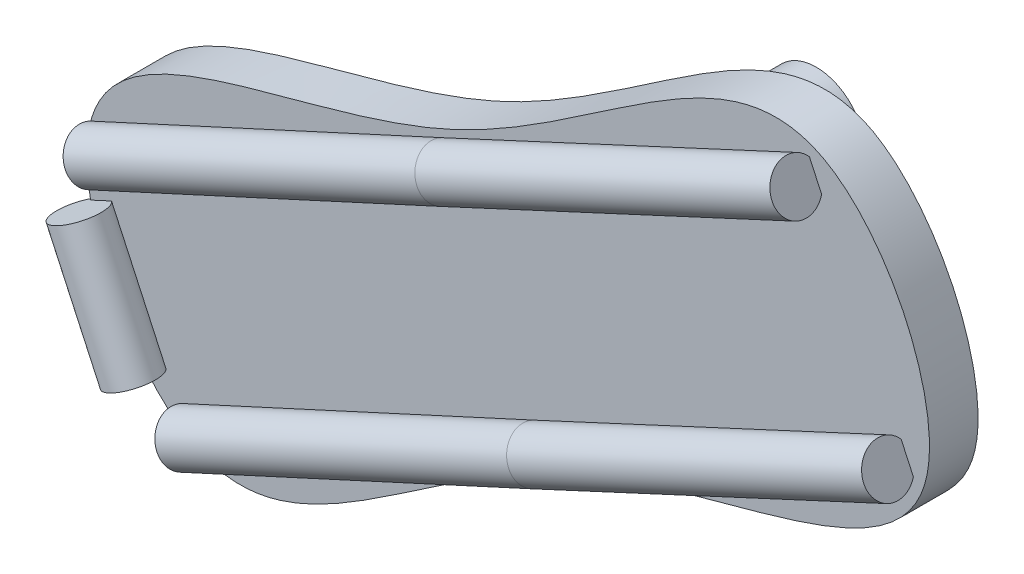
ISO-10303-21;
HEADER;
FILE_DESCRIPTION(('STEP AP214'),'2;1');
FILE_NAME('part.step','',(''),(''),'','','');
FILE_SCHEMA(('AUTOMOTIVE_DESIGN { 1 0 10303 214 1 1 1 1 }'));
ENDSEC;
DATA;
#1=APPLICATION_CONTEXT('core data for automotive mechanical design processes');
#2=APPLICATION_PROTOCOL_DEFINITION('international standard','automotive_design',2000,#1);
#3=PRODUCT_CONTEXT('',#1,'mechanical');
#4=PRODUCT('Part','Part','',(#3));
#5=PRODUCT_RELATED_PRODUCT_CATEGORY('part','',(#4));
#6=PRODUCT_DEFINITION_FORMATION('','',#4);
#7=PRODUCT_DEFINITION_CONTEXT('part definition',#1,'design');
#8=PRODUCT_DEFINITION('design','',#6,#7);
#9=PRODUCT_DEFINITION_SHAPE('','',#8);
#10=(LENGTH_UNIT() NAMED_UNIT(*) SI_UNIT(.MILLI.,.METRE.));
#11=(NAMED_UNIT(*) PLANE_ANGLE_UNIT() SI_UNIT($,.RADIAN.));
#12=(NAMED_UNIT(*) SI_UNIT($,.STERADIAN.) SOLID_ANGLE_UNIT());
#13=UNCERTAINTY_MEASURE_WITH_UNIT(LENGTH_MEASURE(1.E-05),#10,'distance_accuracy_value','');
#14=(GEOMETRIC_REPRESENTATION_CONTEXT(3) GLOBAL_UNCERTAINTY_ASSIGNED_CONTEXT((#13)) GLOBAL_UNIT_ASSIGNED_CONTEXT((#10,
#11,#12)) REPRESENTATION_CONTEXT('',''));
#15=CARTESIAN_POINT('',(0.,0.,0.));
#16=DIRECTION('',(0.,0.,1.));
#17=DIRECTION('',(1.,0.,0.));
#18=AXIS2_PLACEMENT_3D('',#15,#16,#17);
#19=CARTESIAN_POINT('',(429.779372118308,345.627534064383,-19.));
#20=CARTESIAN_POINT('',(429.353777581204,343.448573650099,-19.));
#21=CARTESIAN_POINT('',(430.470394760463,337.686186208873,-19.));
#22=CARTESIAN_POINT('',(440.028296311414,325.706179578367,-19.));
#23=CARTESIAN_POINT('',(456.920427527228,346.479501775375,-19.));
#24=CARTESIAN_POINT('',(483.687704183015,345.856675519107,-19.));
#25=CARTESIAN_POINT('',(480.772191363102,360.902400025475,-19.));
#26=CARTESIAN_POINT('',(471.214289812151,372.88240665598,-19.));
#27=CARTESIAN_POINT('',(454.322158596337,352.109084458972,-19.));
#28=CARTESIAN_POINT('',(431.150657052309,352.648243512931,-19.));
#29=CARTESIAN_POINT('',(429.779372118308,345.627534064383,-19.));
#30=B_SPLINE_CURVE_WITH_KNOTS('',3,(#19,#20,#21,#22,#23,#24,#25,#26,#27,#28,#29),.UNSPECIFIED.,
.T.,.F.,(4,1,1,1,1,1,1,1,4),(0.,0.0592130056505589,0.118426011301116,0.309213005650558,0.5,
0.559213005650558,0.618426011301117,0.809213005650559,1.),.UNSPECIFIED.);
#31=DIRECTION('',(0.,0.,1.));
#32=VECTOR('',#31,1.);
#33=SURFACE_OF_LINEAR_EXTRUSION('',#30,#32);
#34=CARTESIAN_POINT('',(429.779372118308,345.627534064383,-19.));
#35=VERTEX_POINT('',#34);
#36=EDGE_CURVE('E285',#35,#35,#30,.T.);
#37=ORIENTED_EDGE('',*,*,#36,.T.);
#38=EDGE_LOOP('',(#37));
#39=FACE_BOUND('',#38,.T.);
#40=CARTESIAN_POINT('',(431.978308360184,336.329195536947,-16.));
#41=CARTESIAN_POINT('',(432.024911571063,336.251450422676,-16.0072990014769));
#42=CARTESIAN_POINT('',(432.072119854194,336.174102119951,-16.0149528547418));
#43=CARTESIAN_POINT('',(432.167713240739,336.02028840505,-16.0308207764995));
#44=CARTESIAN_POINT('',(432.216097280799,335.943822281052,-16.0390343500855));
#45=CARTESIAN_POINT('',(432.314061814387,335.791770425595,-16.0558805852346));
#46=CARTESIAN_POINT('',(432.363641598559,335.716184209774,-16.0645130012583));
#47=CARTESIAN_POINT('',(432.464023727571,335.565892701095,-16.0820509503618));
#48=CARTESIAN_POINT('',(432.514825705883,335.491187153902,-16.0909564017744));
#49=CARTESIAN_POINT('',(432.617685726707,335.342657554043,-16.1088919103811));
#50=CARTESIAN_POINT('',(432.669743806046,335.268833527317,-16.1179219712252));
#51=CARTESIAN_POINT('',(432.775150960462,335.122078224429,-16.1359528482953));
#52=CARTESIAN_POINT('',(432.828500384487,335.049147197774,-16.1449536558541));
#53=CARTESIAN_POINT('',(432.93653302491,334.904189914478,-16.1627674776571));
#54=CARTESIAN_POINT('',(432.991216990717,334.832164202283,-16.1715803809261));
#55=CARTESIAN_POINT('',(433.10196944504,334.689035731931,-16.1888488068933));
#56=CARTESIAN_POINT('',(433.158039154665,334.617933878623,-16.1973039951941));
#57=CARTESIAN_POINT('',(433.214791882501,334.547347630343,-16.2054899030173));
#58=B_SPLINE_CURVE_WITH_KNOTS('',3,(#40,#41,#42,#43,#44,#45,#46,#47,#48,#49,#50,#51,#52,#53,#54,
#55,#56,#57),.UNSPECIFIED.,.F.,.F.,(4,2,2,2,2,2,2,2,4),(0.,0.272804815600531,0.545371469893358,
0.81778022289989,1.09010827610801,1.36244432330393,1.6348548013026,1.90742194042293,
2.18023849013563),.UNSPECIFIED.);
#59=CARTESIAN_POINT('',(431.978308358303,336.329195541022,-16.));
#60=VERTEX_POINT('',#59);
#61=CARTESIAN_POINT('',(433.214791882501,334.547347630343,-16.2054899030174));
#62=VERTEX_POINT('',#61);
#63=EDGE_CURVE('E164',#60,#62,#58,.T.);
#64=ORIENTED_EDGE('',*,*,#63,.F.);
#65=CARTESIAN_POINT('',(429.779372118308,345.627534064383,-16.));
#66=CARTESIAN_POINT('',(429.353777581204,343.448573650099,-16.));
#67=CARTESIAN_POINT('',(430.470394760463,337.686186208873,-16.));
#68=CARTESIAN_POINT('',(440.028296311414,325.706179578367,-16.));
#69=CARTESIAN_POINT('',(456.920427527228,346.479501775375,-16.));
#70=CARTESIAN_POINT('',(483.687704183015,345.856675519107,-16.));
#71=CARTESIAN_POINT('',(480.772191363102,360.902400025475,-16.));
#72=CARTESIAN_POINT('',(471.214289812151,372.88240665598,-16.));
#73=CARTESIAN_POINT('',(454.322158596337,352.109084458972,-16.));
#74=CARTESIAN_POINT('',(431.150657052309,352.648243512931,-16.));
#75=CARTESIAN_POINT('',(429.779372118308,345.627534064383,-16.));
#76=B_SPLINE_CURVE_WITH_KNOTS('',3,(#65,#66,#67,#68,#69,#70,#71,#72,#73,#74,#75),.UNSPECIFIED.,
.T.,.F.,(4,1,1,1,1,1,1,1,4),(0.,0.0592130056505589,0.118426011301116,0.309213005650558,0.5,
0.559213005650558,0.618426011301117,0.809213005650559,1.),.UNSPECIFIED.);
#77=CARTESIAN_POINT('',(430.416062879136,339.714060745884,-16.));
#78=VERTEX_POINT('',#77);
#79=EDGE_CURVE('E288',#78,#60,#76,.T.);
#80=ORIENTED_EDGE('',*,*,#79,.F.);
#81=CARTESIAN_POINT('',(429.862326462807,341.811022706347,-16.2054899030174));
#82=CARTESIAN_POINT('',(429.879220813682,341.722040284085,-16.1973039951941));
#83=CARTESIAN_POINT('',(429.896950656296,341.633243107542,-16.1888488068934));
#84=CARTESIAN_POINT('',(429.934013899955,341.456104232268,-16.171580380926));
#85=CARTESIAN_POINT('',(429.953345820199,341.367762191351,-16.1627674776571));
#86=CARTESIAN_POINT('',(429.993565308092,341.191506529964,-16.1449536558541));
#87=CARTESIAN_POINT('',(430.014451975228,341.103592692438,-16.1359528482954));
#88=CARTESIAN_POINT('',(430.057743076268,340.928168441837,-16.1179219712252));
#89=CARTESIAN_POINT('',(430.080147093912,340.840657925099,-16.108891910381));
#90=CARTESIAN_POINT('',(430.126440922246,340.666020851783,-16.0909564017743));
#91=CARTESIAN_POINT('',(430.150330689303,340.57889428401,-16.0820509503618));
#92=CARTESIAN_POINT('',(430.199572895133,340.404999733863,-16.0645130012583));
#93=CARTESIAN_POINT('',(430.224925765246,340.3182318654,-16.0558805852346));
#94=CARTESIAN_POINT('',(430.277076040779,340.145034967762,-16.0390343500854));
#95=CARTESIAN_POINT('',(430.303874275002,340.058606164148,-16.0308207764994));
#96=CARTESIAN_POINT('',(430.358903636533,339.886070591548,-16.0149528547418));
#97=CARTESIAN_POINT('',(430.387135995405,339.799964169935,-16.0072990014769));
#98=CARTESIAN_POINT('',(430.416062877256,339.714060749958,-16.));
#99=B_SPLINE_CURVE_WITH_KNOTS('',3,(#81,#82,#83,#84,#85,#86,#87,#88,#89,#90,#91,#92,#93,#94,#95,
#96,#97,#98),.UNSPECIFIED.,.F.,.F.,(4,2,2,2,2,2,2,2,4),(0.,0.27281654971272,0.545383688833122,
0.817794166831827,1.09013021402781,1.36245826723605,1.63486702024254,1.90743367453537,
2.18023849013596),.UNSPECIFIED.);
#100=CARTESIAN_POINT('',(429.862326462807,341.811022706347,-16.2054899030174));
#101=VERTEX_POINT('',#100);
#102=EDGE_CURVE('E168',#101,#78,#99,.T.);
#103=ORIENTED_EDGE('',*,*,#102,.F.);
#104=DIRECTION('',(0.,0.,1.));
#105=VECTOR('',#104,1.);
#106=CARTESIAN_POINT('',(429.862326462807,341.811022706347,-19.));
#107=LINE('',#106,#105);
#108=CARTESIAN_POINT('',(429.862326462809,341.811022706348,-16.));
#109=VERTEX_POINT('',#108);
#110=EDGE_CURVE('E289',#101,#109,#107,.T.);
#111=ORIENTED_EDGE('',*,*,#110,.T.);
#112=CARTESIAN_POINT('',(433.214791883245,334.547347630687,-16.));
#113=VERTEX_POINT('',#112);
#114=EDGE_CURVE('E303',#113,#109,#76,.T.);
#115=ORIENTED_EDGE('',*,*,#114,.F.);
#116=DIRECTION('',(0.,0.,1.));
#117=VECTOR('',#116,1.);
#118=CARTESIAN_POINT('',(433.214791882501,334.547347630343,-19.));
#119=LINE('',#118,#117);
#120=EDGE_CURVE('E172',#62,#113,#119,.T.);
#121=ORIENTED_EDGE('',*,*,#120,.F.);
#122=EDGE_LOOP('',(#64,#80,#103,#111,#115,#121));
#123=FACE_BOUND('',#122,.T.);
#124=ADVANCED_FACE('F79',(#39,#123),#33,.T.);
#125=CARTESIAN_POINT('',(481.463214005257,352.961052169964,-16.));
#126=DIRECTION('',(0.,0.,-1.));
#127=DIRECTION('',(1.,0.,0.));
#128=AXIS2_PLACEMENT_3D('',#125,#126,#127);
#129=PLANE('',#128);
#130=CARTESIAN_POINT('',(736.075978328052,486.169170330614,-16.));
#131=DIRECTION('',(0.,0.,1.));
#132=DIRECTION('',(0.907959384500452,0.419058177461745,0.));
#133=AXIS2_PLACEMENT_3D('',#130,#131,#132);
#134=ELLIPSE('',#133,360.003124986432,1.5);
#135=CARTESIAN_POINT('',(474.956282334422,364.66116909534,-16.));
#136=VERTEX_POINT('',#135);
#137=CARTESIAN_POINT('',(453.106253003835,354.74354657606,-16.));
#138=VERTEX_POINT('',#137);
#139=EDGE_CURVE('E325',#136,#138,#134,.F.);
#140=ORIENTED_EDGE('',*,*,#139,.T.);
#141=CARTESIAN_POINT('',(169.509322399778,224.676867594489,-16.));
#142=DIRECTION('',(0.,0.,1.));
#143=DIRECTION('',(0.907959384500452,0.419058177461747,0.));
#144=AXIS2_PLACEMENT_3D('',#141,#142,#143);
#145=ELLIPSE('',#144,360.003124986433,1.5);
#146=CARTESIAN_POINT('',(431.383311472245,344.550567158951,-16.));
#147=VERTEX_POINT('',#146);
#148=EDGE_CURVE('E321',#138,#147,#145,.F.);
#149=ORIENTED_EDGE('',*,*,#148,.T.);
#150=DIRECTION('',(0.419058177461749,-0.907959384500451,0.));
#151=VECTOR('',#150,1.);
#152=CARTESIAN_POINT('',(436.977743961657,332.429296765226,-16.));
#153=LINE('',#152,#151);
#154=CARTESIAN_POINT('',(430.629018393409,346.184868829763,-16.));
#155=VERTEX_POINT('',#154);
#156=EDGE_CURVE('E324',#155,#147,#153,.T.);
#157=ORIENTED_EDGE('',*,*,#156,.F.);
#158=CARTESIAN_POINT('',(452.479047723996,356.102491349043,-16.));
#159=VERTEX_POINT('',#158);
#160=EDGE_CURVE('E308',#155,#159,#145,.F.);
#161=ORIENTED_EDGE('',*,*,#160,.T.);
#162=CARTESIAN_POINT('',(474.201989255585,366.295470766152,-16.));
#163=VERTEX_POINT('',#162);
#164=EDGE_CURVE('E320',#159,#163,#134,.F.);
#165=ORIENTED_EDGE('',*,*,#164,.T.);
#166=DIRECTION('',(0.419058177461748,-0.907959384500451,0.));
#167=VECTOR('',#166,1.);
#168=CARTESIAN_POINT('',(480.550714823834,352.539898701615,-16.));
#169=LINE('',#168,#167);
#170=EDGE_CURVE('E328',#163,#136,#169,.T.);
#171=ORIENTED_EDGE('',*,*,#170,.T.);
#172=EDGE_LOOP('',(#140,#149,#157,#161,#165,#171));
#173=FACE_BOUND('',#172,.T.);
#174=CARTESIAN_POINT('',(741.733263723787,473.911718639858,-16.));
#175=DIRECTION('',(0.,0.,1.));
#176=DIRECTION('',(0.907959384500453,0.419058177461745,0.));
#177=AXIS2_PLACEMENT_3D('',#174,#175,#176);
#178=ELLIPSE('',#177,360.003124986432,1.5);
#179=CARTESIAN_POINT('',(480.613567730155,352.403717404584,-16.));
#180=VERTEX_POINT('',#179);
#181=CARTESIAN_POINT('',(458.763538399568,342.486094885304,-16.));
#182=VERTEX_POINT('',#181);
#183=EDGE_CURVE('E179',#180,#182,#178,.F.);
#184=ORIENTED_EDGE('',*,*,#183,.T.);
#185=CARTESIAN_POINT('',(175.166607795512,212.419415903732,-16.));
#186=DIRECTION('',(0.,0.,1.));
#187=DIRECTION('',(0.907959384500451,0.419058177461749,0.));
#188=AXIS2_PLACEMENT_3D('',#185,#186,#187);
#189=ELLIPSE('',#188,360.003124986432,1.5);
#190=CARTESIAN_POINT('',(437.040596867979,332.293115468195,-16.));
#191=VERTEX_POINT('',#190);
#192=EDGE_CURVE('E182',#182,#191,#189,.F.);
#193=ORIENTED_EDGE('',*,*,#192,.T.);
#194=DIRECTION('',(0.419058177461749,-0.907959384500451,0.));
#195=VECTOR('',#194,1.);
#196=CARTESIAN_POINT('',(436.977743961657,332.429296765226,-16.));
#197=LINE('',#196,#195);
#198=CARTESIAN_POINT('',(436.286303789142,333.927417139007,-16.));
#199=VERTEX_POINT('',#198);
#200=EDGE_CURVE('E334',#199,#191,#197,.T.);
#201=ORIENTED_EDGE('',*,*,#200,.F.);
#202=CARTESIAN_POINT('',(458.13633311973,343.845039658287,-16.));
#203=VERTEX_POINT('',#202);
#204=EDGE_CURVE('E331',#199,#203,#189,.F.);
#205=ORIENTED_EDGE('',*,*,#204,.T.);
#206=CARTESIAN_POINT('',(479.859274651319,354.038019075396,-16.));
#207=VERTEX_POINT('',#206);
#208=EDGE_CURVE('E184',#203,#207,#178,.F.);
#209=ORIENTED_EDGE('',*,*,#208,.T.);
#210=DIRECTION('',(0.419058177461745,-0.907959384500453,0.));
#211=VECTOR('',#210,1.);
#212=CARTESIAN_POINT('',(480.550714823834,352.539898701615,-16.));
#213=LINE('',#212,#211);
#214=EDGE_CURVE('E186',#207,#180,#213,.T.);
#215=ORIENTED_EDGE('',*,*,#214,.T.);
#216=EDGE_LOOP('',(#184,#193,#201,#205,#209,#215));
#217=FACE_BOUND('',#216,.T.);
#218=DIRECTION('',(0.907959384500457,0.419058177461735,0.));
#219=VECTOR('',#218,1.);
#220=CARTESIAN_POINT('',(476.644044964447,363.402585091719,-16.));
#221=LINE('',#220,#219);
#222=CARTESIAN_POINT('',(431.155279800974,342.407770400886,-16.));
#223=VERTEX_POINT('',#222);
#224=EDGE_CURVE('E176',#109,#223,#221,.T.);
#225=ORIENTED_EDGE('',*,*,#224,.T.);
#226=DIRECTION('',(0.419058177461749,-0.907959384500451,0.));
#227=VECTOR('',#226,1.);
#228=CARTESIAN_POINT('',(431.155279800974,342.407770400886,-16.));
#229=LINE('',#228,#227);
#230=CARTESIAN_POINT('',(434.507745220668,335.144095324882,-16.));
#231=VERTEX_POINT('',#230);
#232=EDGE_CURVE('E161',#231,#223,#229,.F.);
#233=ORIENTED_EDGE('',*,*,#232,.F.);
#234=DIRECTION('',(0.907959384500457,0.419058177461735,0.));
#235=VECTOR('',#234,1.);
#236=CARTESIAN_POINT('',(479.996510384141,356.138910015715,-16.));
#237=LINE('',#236,#235);
#238=EDGE_CURVE('E170',#113,#231,#237,.T.);
#239=ORIENTED_EDGE('',*,*,#238,.F.);
#240=ORIENTED_EDGE('',*,*,#114,.T.);
#241=EDGE_LOOP('',(#225,#233,#239,#240));
#242=FACE_BOUND('',#241,.T.);
#243=ADVANCED_FACE('F178',(#173,#217,#242),#129,.F.);
#244=CARTESIAN_POINT('',(481.463214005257,352.961052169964,-19.));
#245=DIRECTION('',(0.,0.,-1.));
#246=DIRECTION('',(1.,0.,0.));
#247=AXIS2_PLACEMENT_3D('',#244,#245,#246);
#248=PLANE('',#247);
#249=CARTESIAN_POINT('',(455.621293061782,349.294293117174,-19.));
#250=DIRECTION('',(0.,0.,1.));
#251=DIRECTION('',(1.,0.,0.));
#252=AXIS2_PLACEMENT_3D('',#249,#250,#251);
#253=CIRCLE('',#252,5.50000000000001);
#254=CARTESIAN_POINT('',(461.121293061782,349.294293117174,-19.));
#255=VERTEX_POINT('',#254);
#256=EDGE_CURVE('E12',#255,#255,#253,.T.);
#257=ORIENTED_EDGE('',*,*,#256,.T.);
#258=EDGE_LOOP('',(#257));
#259=FACE_BOUND('',#258,.T.);
#260=ORIENTED_EDGE('',*,*,#36,.F.);
#261=EDGE_LOOP('',(#260));
#262=FACE_BOUND('',#261,.T.);
#263=ADVANCED_FACE('F268',(#259,#262),#248,.T.);
#264=ORIENTED_EDGE('',*,*,#79,.T.);
#265=DIRECTION('',(0.419058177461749,-0.907959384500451,0.));
#266=VECTOR('',#265,1.);
#267=CARTESIAN_POINT('',(429.520952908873,341.653465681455,-16.));
#268=LINE('',#267,#266);
#269=EDGE_CURVE('E190',#78,#60,#268,.T.);
#270=ORIENTED_EDGE('',*,*,#269,.F.);
#271=EDGE_LOOP('',(#264,#270));
#272=FACE_BOUND('',#271,.T.);
#273=ADVANCED_FACE('F266',(#272),#129,.F.);
#274=CARTESIAN_POINT('',(474.583675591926,365.480415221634,-14.8));
#275=DIRECTION('',(-0.907951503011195,-0.419054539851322,0.00416663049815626));
#276=DIRECTION('',(0.419058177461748,-0.907959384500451,0.));
#277=AXIS2_PLACEMENT_3D('',#274,#275,#276);
#278=PLANE('',#277);
#279=CARTESIAN_POINT('',(474.583675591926,365.480415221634,-14.8));
#280=DIRECTION('',(0.907951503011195,0.419054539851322,-0.00416663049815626));
#281=DIRECTION('',(0.419058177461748,-0.907959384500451,0.));
#282=AXIS2_PLACEMENT_3D('',#279,#280,#281);
#283=CIRCLE('',#282,1.5);
#284=EDGE_CURVE('E297',#163,#136,#283,.T.);
#285=ORIENTED_EDGE('',*,*,#284,.T.);
#286=ORIENTED_EDGE('',*,*,#170,.F.);
#287=EDGE_LOOP('',(#285,#286));
#288=FACE_BOUND('',#287,.T.);
#289=ADVANCED_FACE('F262',(#288),#278,.F.);
#290=CARTESIAN_POINT('',(431.001625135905,345.36562270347,-14.8));
#291=DIRECTION('',(-0.907951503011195,-0.419054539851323,-0.0041666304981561));
#292=DIRECTION('',(0.419058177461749,-0.907959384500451,0.));
#293=AXIS2_PLACEMENT_3D('',#290,#291,#292);
#294=PLANE('',#293);
#295=ORIENTED_EDGE('',*,*,#156,.T.);
#296=CARTESIAN_POINT('',(431.001625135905,345.36562270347,-14.8));
#297=DIRECTION('',(0.907951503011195,0.419054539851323,0.0041666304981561));
#298=DIRECTION('',(0.419058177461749,-0.907959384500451,0.));
#299=AXIS2_PLACEMENT_3D('',#296,#297,#298);
#300=CIRCLE('',#299,1.5);
#301=EDGE_CURVE('E299',#155,#147,#300,.T.);
#302=ORIENTED_EDGE('',*,*,#301,.F.);
#303=EDGE_LOOP('',(#295,#302));
#304=FACE_BOUND('',#303,.T.);
#305=ADVANCED_FACE('F258',(#304),#294,.T.);
#306=CARTESIAN_POINT('',(452.611060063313,355.339208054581,-14.6991666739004));
#307=DIRECTION('',(0.907951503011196,0.419054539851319,-0.00416663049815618));
#308=DIRECTION('',(-0.419058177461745,0.907959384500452,0.));
#309=AXIS2_PLACEMENT_3D('',#306,#307,#308);
#310=CYLINDRICAL_SURFACE('',#309,1.5);
#311=ORIENTED_EDGE('',*,*,#284,.F.);
#312=ORIENTED_EDGE('',*,*,#164,.F.);
#313=CARTESIAN_POINT('',(452.792650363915,355.423018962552,-14.7));
#314=DIRECTION('',(-0.907959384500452,-0.419058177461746,0.));
#315=DIRECTION('',(0.,1.20967902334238E-13,1.));
#316=AXIS2_PLACEMENT_3D('',#313,#314,#315);
#317=ELLIPSE('',#316,1.50001302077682,1.5);
#318=EDGE_CURVE('E301',#138,#159,#317,.T.);
#319=ORIENTED_EDGE('',*,*,#318,.F.);
#320=ORIENTED_EDGE('',*,*,#139,.F.);
#321=EDGE_LOOP('',(#311,#312,#319,#320));
#322=FACE_BOUND('',#321,.T.);
#323=ADVANCED_FACE('F254',(#322),#310,.T.);
#324=CARTESIAN_POINT('',(431.001625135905,345.36562270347,-14.8));
#325=DIRECTION('',(0.907951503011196,0.419054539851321,0.00416663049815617));
#326=DIRECTION('',(-0.419058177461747,0.907959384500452,0.));
#327=AXIS2_PLACEMENT_3D('',#324,#325,#326);
#328=CYLINDRICAL_SURFACE('',#327,1.5);
#329=ORIENTED_EDGE('',*,*,#318,.T.);
#330=ORIENTED_EDGE('',*,*,#160,.F.);
#331=ORIENTED_EDGE('',*,*,#301,.T.);
#332=ORIENTED_EDGE('',*,*,#148,.F.);
#333=EDGE_LOOP('',(#329,#330,#331,#332));
#334=FACE_BOUND('',#333,.T.);
#335=ADVANCED_FACE('F250',(#334),#328,.T.);
#336=CARTESIAN_POINT('',(480.24096098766,353.222963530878,-14.8));
#337=DIRECTION('',(-0.907951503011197,-0.419054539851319,0.0041666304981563));
#338=DIRECTION('',(0.419058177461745,-0.907959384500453,0.));
#339=AXIS2_PLACEMENT_3D('',#336,#337,#338);
#340=PLANE('',#339);
#341=CARTESIAN_POINT('',(480.24096098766,353.222963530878,-14.8));
#342=DIRECTION('',(0.907951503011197,0.419054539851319,-0.0041666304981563));
#343=DIRECTION('',(0.419058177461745,-0.907959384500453,0.));
#344=AXIS2_PLACEMENT_3D('',#341,#342,#343);
#345=CIRCLE('',#344,1.5);
#346=EDGE_CURVE('E291',#207,#180,#345,.T.);
#347=ORIENTED_EDGE('',*,*,#346,.T.);
#348=ORIENTED_EDGE('',*,*,#214,.F.);
#349=EDGE_LOOP('',(#347,#348));
#350=FACE_BOUND('',#349,.T.);
#351=ADVANCED_FACE('F246',(#350),#340,.F.);
#352=CARTESIAN_POINT('',(436.658910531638,333.108171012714,-14.8));
#353=DIRECTION('',(-0.907951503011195,-0.419054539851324,-0.00416663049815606));
#354=DIRECTION('',(0.41905817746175,-0.907959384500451,0.));
#355=AXIS2_PLACEMENT_3D('',#352,#353,#354);
#356=PLANE('',#355);
#357=ORIENTED_EDGE('',*,*,#200,.T.);
#358=CARTESIAN_POINT('',(436.658910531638,333.108171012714,-14.8));
#359=DIRECTION('',(0.907951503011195,0.419054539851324,0.00416663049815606));
#360=DIRECTION('',(0.41905817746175,-0.907959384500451,0.));
#361=AXIS2_PLACEMENT_3D('',#358,#359,#360);
#362=CIRCLE('',#361,1.5);
#363=EDGE_CURVE('E294',#199,#191,#362,.T.);
#364=ORIENTED_EDGE('',*,*,#363,.F.);
#365=EDGE_LOOP('',(#357,#364));
#366=FACE_BOUND('',#365,.T.);
#367=ADVANCED_FACE('F243',(#366),#356,.T.);
#368=CARTESIAN_POINT('',(458.268345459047,343.081756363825,-14.6991666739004));
#369=DIRECTION('',(0.907951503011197,0.419054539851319,-0.00416663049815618));
#370=DIRECTION('',(-0.419058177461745,0.907959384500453,0.));
#371=AXIS2_PLACEMENT_3D('',#368,#369,#370);
#372=CYLINDRICAL_SURFACE('',#371,1.5);
#373=ORIENTED_EDGE('',*,*,#346,.F.);
#374=ORIENTED_EDGE('',*,*,#208,.F.);
#375=CARTESIAN_POINT('',(458.449935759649,343.165567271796,-14.7));
#376=DIRECTION('',(-0.907959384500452,-0.419058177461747,0.));
#377=DIRECTION('',(-2.45653096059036E-13,5.32248374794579E-13,1.));
#378=AXIS2_PLACEMENT_3D('',#375,#376,#377);
#379=ELLIPSE('',#378,1.50001302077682,1.5);
#380=EDGE_CURVE('E103',#182,#203,#379,.T.);
#381=ORIENTED_EDGE('',*,*,#380,.F.);
#382=ORIENTED_EDGE('',*,*,#183,.F.);
#383=EDGE_LOOP('',(#373,#374,#381,#382));
#384=FACE_BOUND('',#383,.T.);
#385=ADVANCED_FACE('F239',(#384),#372,.T.);
#386=CARTESIAN_POINT('',(436.658910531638,333.108171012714,-14.8));
#387=DIRECTION('',(0.907951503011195,0.419054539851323,0.00416663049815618));
#388=DIRECTION('',(-0.419058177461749,0.907959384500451,0.));
#389=AXIS2_PLACEMENT_3D('',#386,#387,#388);
#390=CYLINDRICAL_SURFACE('',#389,1.5);
#391=ORIENTED_EDGE('',*,*,#380,.T.);
#392=ORIENTED_EDGE('',*,*,#204,.F.);
#393=ORIENTED_EDGE('',*,*,#363,.T.);
#394=ORIENTED_EDGE('',*,*,#192,.F.);
#395=EDGE_LOOP('',(#391,#392,#393,#394));
#396=FACE_BOUND('',#395,.T.);
#397=ADVANCED_FACE('F236',(#396),#390,.T.);
#398=CARTESIAN_POINT('',(430.338116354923,342.03061804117,-14.8));
#399=DIRECTION('',(0.419058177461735,-0.907959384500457,0.));
#400=DIRECTION('',(0.907959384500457,0.419058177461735,0.));
#401=AXIS2_PLACEMENT_3D('',#398,#399,#400);
#402=PLANE('',#401);
#403=CARTESIAN_POINT('',(430.338116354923,342.03061804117,-14.8));
#404=DIRECTION('',(-0.419058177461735,0.907959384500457,0.));
#405=DIRECTION('',(0.907959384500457,0.419058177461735,0.));
#406=AXIS2_PLACEMENT_3D('',#403,#404,#405);
#407=CIRCLE('',#406,1.5);
#408=EDGE_CURVE('E95',#101,#223,#407,.T.);
#409=ORIENTED_EDGE('',*,*,#408,.T.);
#410=ORIENTED_EDGE('',*,*,#224,.F.);
#411=ORIENTED_EDGE('',*,*,#110,.F.);
#412=EDGE_LOOP('',(#409,#410,#411));
#413=FACE_BOUND('',#412,.T.);
#414=ADVANCED_FACE('F233',(#413),#402,.F.);
#415=CARTESIAN_POINT('',(433.690581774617,334.766942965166,-14.8));
#416=DIRECTION('',(0.419058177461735,-0.907959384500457,0.));
#417=DIRECTION('',(0.907959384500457,0.419058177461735,0.));
#418=AXIS2_PLACEMENT_3D('',#415,#416,#417);
#419=PLANE('',#418);
#420=ORIENTED_EDGE('',*,*,#120,.T.);
#421=ORIENTED_EDGE('',*,*,#238,.T.);
#422=CARTESIAN_POINT('',(433.690581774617,334.766942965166,-14.8));
#423=DIRECTION('',(-0.419058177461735,0.907959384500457,0.));
#424=DIRECTION('',(0.907959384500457,0.419058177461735,0.));
#425=AXIS2_PLACEMENT_3D('',#422,#423,#424);
#426=CIRCLE('',#425,1.5);
#427=EDGE_CURVE('E157',#62,#231,#426,.T.);
#428=ORIENTED_EDGE('',*,*,#427,.F.);
#429=EDGE_LOOP('',(#420,#421,#428));
#430=FACE_BOUND('',#429,.T.);
#431=ADVANCED_FACE('F171',(#430),#419,.T.);
#432=CARTESIAN_POINT('',(430.338116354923,342.03061804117,-14.8));
#433=DIRECTION('',(0.419058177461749,-0.907959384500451,0.));
#434=DIRECTION('',(0.907959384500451,0.419058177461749,0.));
#435=AXIS2_PLACEMENT_3D('',#432,#433,#434);
#436=CYLINDRICAL_SURFACE('',#435,1.5);
#437=ORIENTED_EDGE('',*,*,#63,.T.);
#438=ORIENTED_EDGE('',*,*,#427,.T.);
#439=ORIENTED_EDGE('',*,*,#232,.T.);
#440=ORIENTED_EDGE('',*,*,#408,.F.);
#441=ORIENTED_EDGE('',*,*,#102,.T.);
#442=ORIENTED_EDGE('',*,*,#269,.T.);
#443=EDGE_LOOP('',(#437,#438,#439,#440,#441,#442));
#444=FACE_BOUND('',#443,.T.);
#445=ADVANCED_FACE('F159',(#444),#436,.T.);
#446=CARTESIAN_POINT('',(455.621293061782,349.294293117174,-20.));
#447=DIRECTION('',(0.,0.,-1.));
#448=DIRECTION('',(1.,0.,0.));
#449=AXIS2_PLACEMENT_3D('',#446,#447,#448);
#450=PLANE('',#449);
#451=CARTESIAN_POINT('',(455.621293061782,349.294293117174,-20.));
#452=DIRECTION('',(0.,0.,1.));
#453=DIRECTION('',(1.,0.,0.));
#454=AXIS2_PLACEMENT_3D('',#451,#452,#453);
#455=CIRCLE('',#454,3.);
#456=CARTESIAN_POINT('',(458.621293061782,349.294293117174,-20.));
#457=VERTEX_POINT('',#456);
#458=EDGE_CURVE('E88',#457,#457,#455,.F.);
#459=ORIENTED_EDGE('',*,*,#458,.F.);
#460=EDGE_LOOP('',(#459));
#461=FACE_BOUND('',#460,.T.);
#462=CARTESIAN_POINT('',(455.621293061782,349.294293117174,-20.));
#463=DIRECTION('',(0.,0.,1.));
#464=DIRECTION('',(1.,0.,0.));
#465=AXIS2_PLACEMENT_3D('',#462,#463,#464);
#466=CIRCLE('',#465,5.50000000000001);
#467=CARTESIAN_POINT('',(461.121293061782,349.294293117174,-20.));
#468=VERTEX_POINT('',#467);
#469=EDGE_CURVE('E204',#468,#468,#466,.T.);
#470=ORIENTED_EDGE('',*,*,#469,.F.);
#471=EDGE_LOOP('',(#470));
#472=FACE_BOUND('',#471,.T.);
#473=ADVANCED_FACE('F197',(#461,#472),#450,.T.);
#474=CARTESIAN_POINT('',(455.621293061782,349.294293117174,-18.));
#475=DIRECTION('',(0.,0.,-1.));
#476=DIRECTION('',(1.,0.,0.));
#477=AXIS2_PLACEMENT_3D('',#474,#475,#476);
#478=CYLINDRICAL_SURFACE('',#477,5.50000000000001);
#479=ORIENTED_EDGE('',*,*,#256,.F.);
#480=EDGE_LOOP('',(#479));
#481=FACE_BOUND('',#480,.T.);
#482=ORIENTED_EDGE('',*,*,#469,.T.);
#483=EDGE_LOOP('',(#482));
#484=FACE_BOUND('',#483,.T.);
#485=ADVANCED_FACE('F200',(#481,#484),#478,.T.);
#486=CARTESIAN_POINT('',(455.621293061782,349.294293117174,-35.));
#487=DIRECTION('',(0.,0.,-1.));
#488=DIRECTION('',(1.,0.,0.));
#489=AXIS2_PLACEMENT_3D('',#486,#487,#488);
#490=PLANE('',#489);
#491=CARTESIAN_POINT('',(455.621293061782,349.294293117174,-35.));
#492=DIRECTION('',(0.,0.,1.));
#493=DIRECTION('',(1.,0.,0.));
#494=AXIS2_PLACEMENT_3D('',#491,#492,#493);
#495=CIRCLE('',#494,3.);
#496=CARTESIAN_POINT('',(458.621293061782,349.294293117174,-35.));
#497=VERTEX_POINT('',#496);
#498=EDGE_CURVE('E206',#497,#497,#495,.T.);
#499=ORIENTED_EDGE('',*,*,#498,.F.);
#500=EDGE_LOOP('',(#499));
#501=FACE_BOUND('',#500,.T.);
#502=ADVANCED_FACE('F228',(#501),#490,.T.);
#503=CARTESIAN_POINT('',(455.621293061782,349.294293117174,-18.));
#504=DIRECTION('',(0.,0.,-1.));
#505=DIRECTION('',(1.,0.,0.));
#506=AXIS2_PLACEMENT_3D('',#503,#504,#505);
#507=CYLINDRICAL_SURFACE('',#506,3.);
#508=ORIENTED_EDGE('',*,*,#458,.T.);
#509=EDGE_LOOP('',(#508));
#510=FACE_BOUND('',#509,.T.);
#511=ORIENTED_EDGE('',*,*,#498,.T.);
#512=EDGE_LOOP('',(#511));
#513=FACE_BOUND('',#512,.T.);
#514=ADVANCED_FACE('F194',(#510,#513),#507,.T.);
#515=CLOSED_SHELL('',(#124,#243,#263,#273,#289,#305,#323,#335,#351,#367,#385,#397,#414,#431,
#445,#473,#485,#502,#514));
#516=MANIFOLD_SOLID_BREP('B2',#515);
#517=ADVANCED_BREP_SHAPE_REPRESENTATION('',(#18,#516),#14);
#518=SHAPE_DEFINITION_REPRESENTATION(#9,#517);
ENDSEC;
END-ISO-10303-21;
